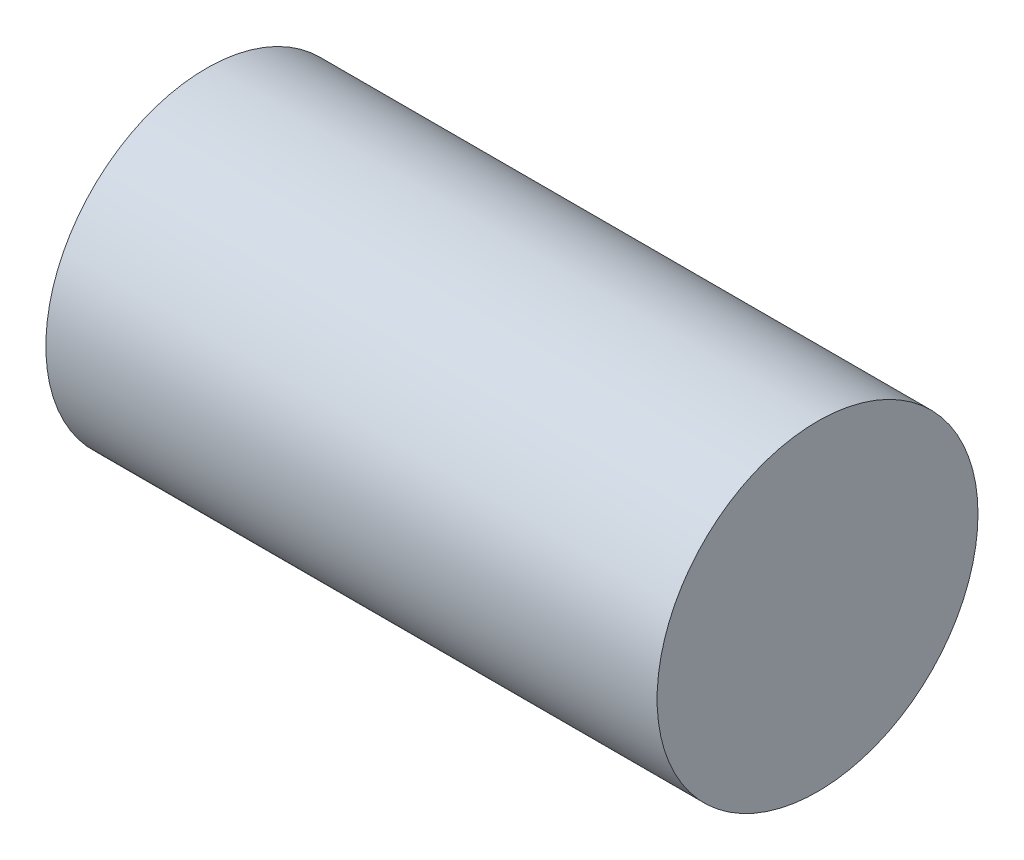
from build123d import *

# Parameters (mm, degrees)
SKETCH_1_R      = 21
EXTRUDE_1_DEPTH = 80


with BuildPart() as part:
    # Sketch 1 → Extrude 1 (new body)
    with BuildSketch(Plane(origin=(0, 0, 0), x_dir=(0, 0, -1), z_dir=(1, 0, 0))):
        with Locations((-31.249075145, 14.108724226)):
            Circle(SKETCH_1_R)
    extrude(amount=EXTRUDE_1_DEPTH)


solid = part.part
